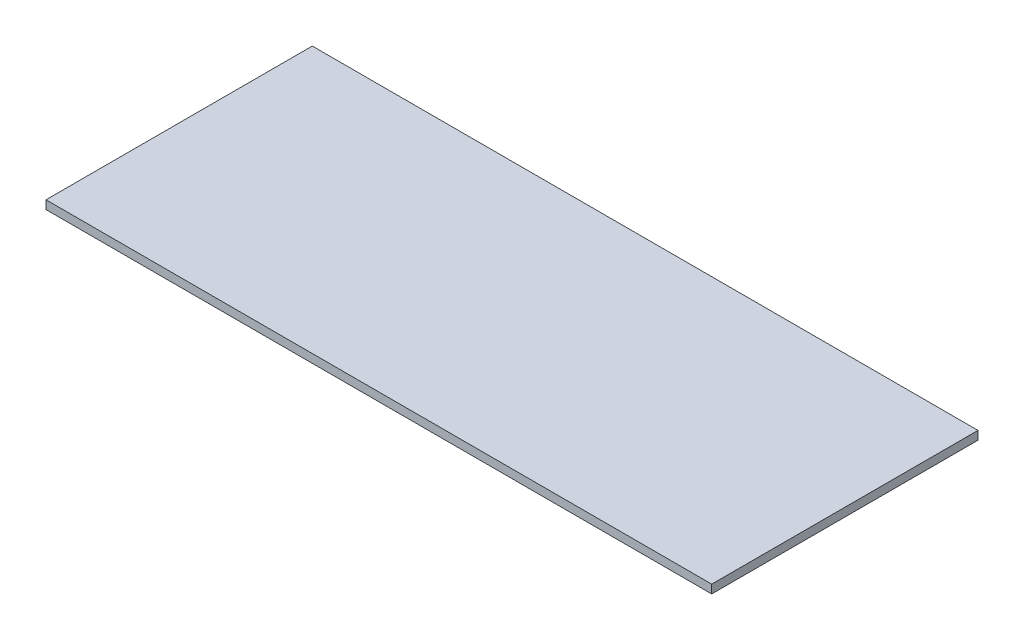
from build123d import *

# Parameters (mm, degrees)
SKETCH1_W           = 63.5
SKETCH1_H           = 25.4
BOSS_EXTRUDE1_DEPTH = 0.8128


with BuildPart() as part:
    # Sketch1 → Boss-Extrude1 (new body)
    with BuildSketch(Plane(origin=(0, 0, 0), x_dir=(1, 0, 0), z_dir=(0, 1, 0))):
        with Locations((31.75, 12.7)):
            Rectangle(SKETCH1_W, SKETCH1_H)
    extrude(amount=BOSS_EXTRUDE1_DEPTH)


solid = part.part
